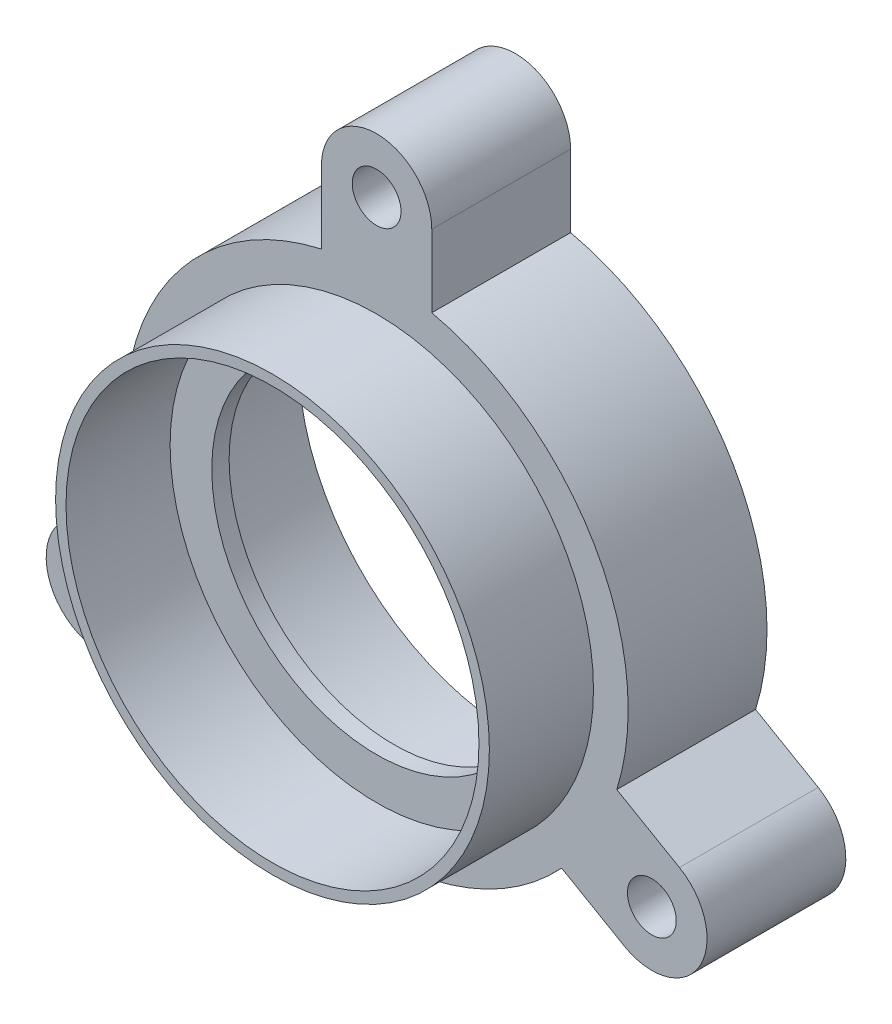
from build123d import *

# Parameters (mm, degrees)
SKETCH1_R           = 14.5
SKETCH1_R_2         = 12.5
BASE_EXTRUDE_DEPTH  = 8
BOSS_EXTRUDE2_START = -1
SKETCH7_R           = 12.5
SKETCH7_R_2         = 9.5
BOSS_EXTRUDE2_DEPTH = 1
SKETCH8_R           = 12.5
SKETCH8_R_2         = 11.9
BOSS_EXTRUDE6_DEPTH = 6
BOSS_EXTRUDE7_START = -8
SKETCH5_R           = 1.405
BOSS_EXTRUDE7_DEPTH = 8


with BuildPart() as part:
    # Sketch1 → Base-Extrude (new body)
    with BuildSketch(Plane.XY):
        Circle(SKETCH1_R)
        Circle(SKETCH1_R_2, mode=Mode.SUBTRACT)
    extrude(amount=BASE_EXTRUDE_DEPTH)

    # Sketch7 → Boss-Extrude2 (add)
    with BuildSketch(Plane.XY.offset(8).offset(BOSS_EXTRUDE2_START)):
        Circle(SKETCH7_R)
        Circle(SKETCH7_R_2, mode=Mode.SUBTRACT)
    extrude(amount=BOSS_EXTRUDE2_DEPTH)

    # Sketch8 → Boss-Extrude6 (add)
    with BuildSketch(Plane.XY.offset(8)):
        Circle(SKETCH8_R)
        Circle(SKETCH8_R_2, mode=Mode.SUBTRACT)
    extrude(amount=BOSS_EXTRUDE6_DEPTH)

    # Sketch5 → Boss-Extrude7 (add)
    # profile 1 of 3: a face of its own
    with BuildSketch(Plane.XY.offset(8).offset(BOSS_EXTRUDE7_START)):
        with BuildLine():
            Line((3.18, 14.146999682), (3.18, 18.316999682))
            ThreePointArc((3.18, 18.316999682), (0, 21.496999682), (-3.18, 18.316999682))
            Line((-3.18, 18.316999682), (-3.18, 14.146999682))
            ThreePointArc((-3.18, 14.146999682), (0, 14.5), (3.18, 14.146999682))
        make_face()
        with Locations((0, 18.316999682)):
            Circle(SKETCH5_R, mode=Mode.SUBTRACT)
    # profile 2 of 3: a face of its own
    with BuildSketch(Plane.XY.offset(8).offset(BOSS_EXTRUDE7_START)):
        with BuildLine():
            Line((13.841661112, -4.319539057), (17.452987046, -6.404539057))
            ThreePointArc((17.452987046, -6.404539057), (18.61694783, -10.748499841), (14.272987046, -11.912460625))
            Line((14.272987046, -11.912460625), (10.661661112, -9.827460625))
            ThreePointArc((10.661661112, -9.827460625), (12.557368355, -7.25), (13.841661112, -4.319539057))
        make_face()
        with Locations(Location((15.862987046, -9.158499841, 0), (0, 0, 180))):
            Circle(SKETCH5_R, mode=Mode.SUBTRACT)
    # profile 3 of 3: a face of its own
    with BuildSketch(Plane.XY.offset(8).offset(BOSS_EXTRUDE7_START)):
        with BuildLine():
            Line((-10.661661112, -9.827460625), (-14.272987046, -11.912460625))
            ThreePointArc((-14.272987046, -11.912460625), (-18.61694783, -10.748499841), (-17.452987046, -6.404539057))
            Line((-17.452987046, -6.404539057), (-13.841661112, -4.319539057))
            ThreePointArc((-13.841661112, -4.319539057), (-12.557368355, -7.25), (-10.661661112, -9.827460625))
        make_face()
        with Locations((-15.862987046, -9.158499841)):
            Circle(SKETCH5_R, mode=Mode.SUBTRACT)
    extrude(amount=BOSS_EXTRUDE7_DEPTH)


solid = part.part
